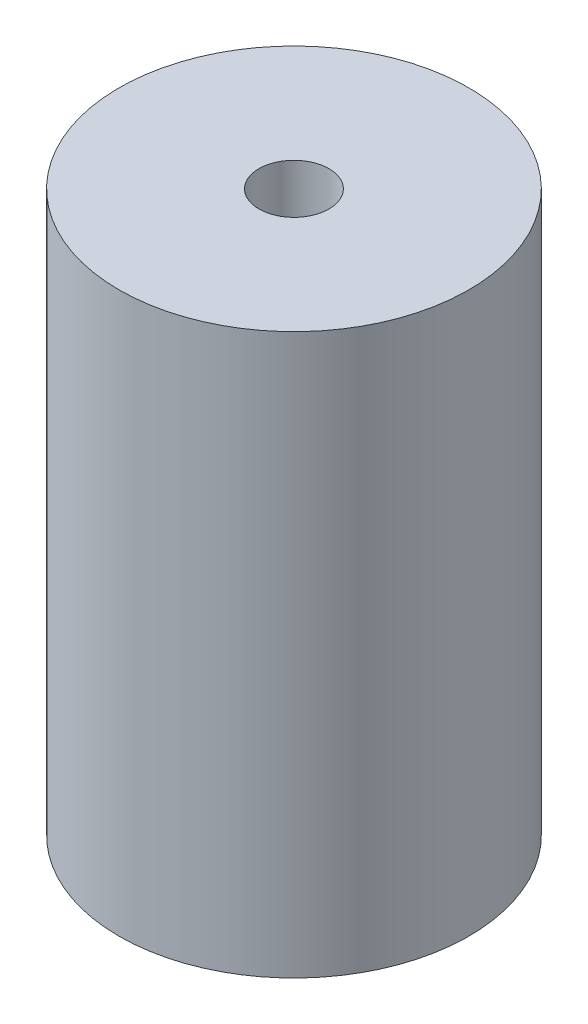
from build123d import *

# Parameters (mm, degrees)
SKETCH1_R      = 5
SKETCH1_R_2    = 1
EXTRUDE1_DEPTH = 16


with BuildPart() as part:
    # Sketch1 → Extrude1 (new body)
    with BuildSketch(Plane(origin=(0, 0, 0), x_dir=(1, 0, 0), z_dir=(0, 1, 0))):
        with Locations(Location((0, 0, 0), (0, 0, 270))):
            Circle(SKETCH1_R)
        with Locations(Location((0, 0, 0), (0, 0, 270))):
            Circle(SKETCH1_R_2, mode=Mode.SUBTRACT)
    extrude(amount=EXTRUDE1_DEPTH)


solid = part.part
